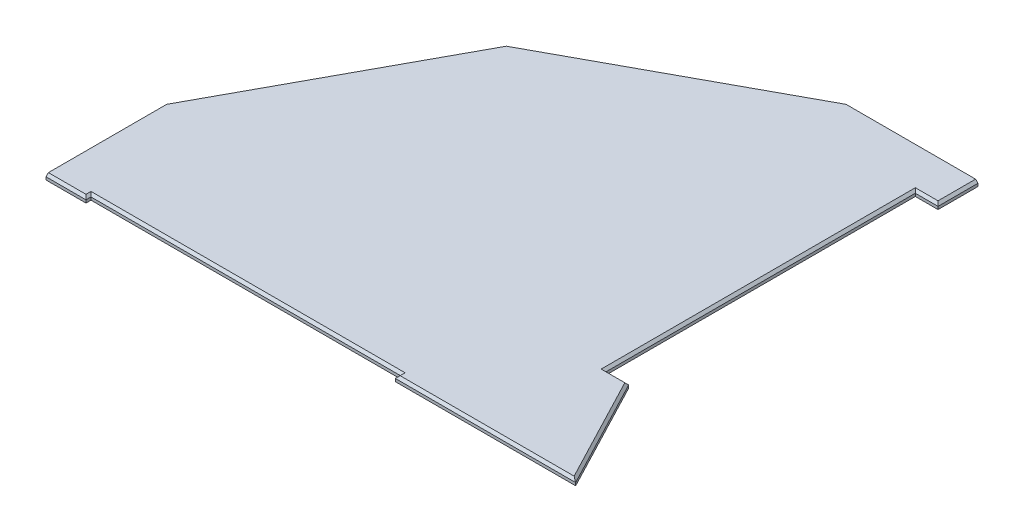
from build123d import *

# Parameters (mm, degrees)
BOSS_EXTRUDE2_DEPTH = 9.525
CHAMFER1_SIZE       = 6


with BuildPart() as part:
    # Sketch2 → Boss-Extrude2 (new, symmetric)
    with BuildSketch(Plane(origin=(0, 0, 0), x_dir=(-1, 0, 0), z_dir=(0, 1, 0))):
        Polygon((604.715914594, 547.712647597), (604.715914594, 560.237647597), (704.715914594, 560.237647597), (704.715914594, 258.331543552), (405.744758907, -292.581496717), (-145.168281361, -591.552652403), (-475.296585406, -591.552652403), (-475.296585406, -491.552652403), (-418.496585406, -491.552652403), (-418.496585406, 282.447347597), (-475.296585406, 282.447347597), (-620.484085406, 560.237647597), (-169.284085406, 560.237647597), (-169.284085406, 547.712647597), align=None)
    extrude(amount=BOSS_EXTRUDE2_DEPTH, both=True)

    # Chamfer1
    chamfer1_edges = [part.edges().sort_by_distance(p)[0] for p in [
        (475.296585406, -9.525, -541.552652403),
        (446.896585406, -9.525, -491.552652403),
        (418.496585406, -9.525, -104.552652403),
        (446.896585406, -9.525, 282.447347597),
        (547.890335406, -9.525, 421.342497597),
        (394.884085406, -9.525, 560.237647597),
        (169.284085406, -9.525, 553.975147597),
        (-654.715914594, 9.525, 560.237647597),
        (-217.715914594, -9.525, 547.712647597),
        (-604.715914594, -9.525, 553.975147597),
        (-654.715914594, -9.525, 560.237647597),
        (-604.715914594, 9.525, 553.975147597),
        (-217.715914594, 9.525, 547.712647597),
        (169.284085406, 9.525, 553.975147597),
        (394.884085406, 9.525, 560.237647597),
        (547.890335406, 9.525, 421.342497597),
        (446.896585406, 9.525, 282.447347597),
        (418.496585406, 9.525, -104.552652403),
        (446.896585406, 9.525, -491.552652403),
        (475.296585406, 9.525, -541.552652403),
    ]]
    chamfer(chamfer1_edges, length=CHAMFER1_SIZE)


solid = part.part
